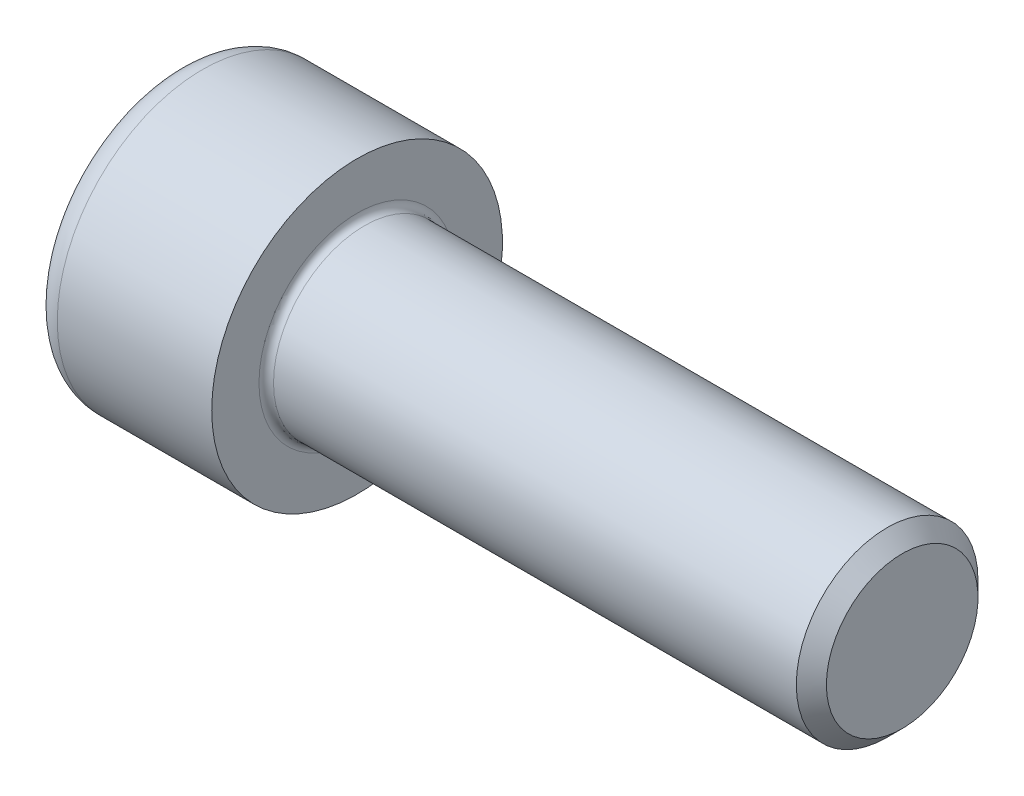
ISO-10303-21;
HEADER;
FILE_DESCRIPTION(('STEP AP214'),'2;1');
FILE_NAME('part.step','',(''),(''),'','','');
FILE_SCHEMA(('AUTOMOTIVE_DESIGN { 1 0 10303 214 1 1 1 1 }'));
ENDSEC;
DATA;
#1=APPLICATION_CONTEXT('core data for automotive mechanical design processes');
#2=APPLICATION_PROTOCOL_DEFINITION('international standard','automotive_design',2000,#1);
#3=PRODUCT_CONTEXT('',#1,'mechanical');
#4=PRODUCT('Part','Part','',(#3));
#5=PRODUCT_RELATED_PRODUCT_CATEGORY('part','',(#4));
#6=PRODUCT_DEFINITION_FORMATION('','',#4);
#7=PRODUCT_DEFINITION_CONTEXT('part definition',#1,'design');
#8=PRODUCT_DEFINITION('design','',#6,#7);
#9=PRODUCT_DEFINITION_SHAPE('','',#8);
#10=(LENGTH_UNIT() NAMED_UNIT(*) SI_UNIT(.MILLI.,.METRE.));
#11=(NAMED_UNIT(*) PLANE_ANGLE_UNIT() SI_UNIT($,.RADIAN.));
#12=(NAMED_UNIT(*) SI_UNIT($,.STERADIAN.) SOLID_ANGLE_UNIT());
#13=UNCERTAINTY_MEASURE_WITH_UNIT(LENGTH_MEASURE(1.E-05),#10,'distance_accuracy_value','');
#14=(GEOMETRIC_REPRESENTATION_CONTEXT(3) GLOBAL_UNCERTAINTY_ASSIGNED_CONTEXT((#13)) GLOBAL_UNIT_ASSIGNED_CONTEXT((#10,
#11,#12)) REPRESENTATION_CONTEXT('',''));
#15=CARTESIAN_POINT('',(0.,0.,0.));
#16=DIRECTION('',(0.,0.,1.));
#17=DIRECTION('',(1.,0.,0.));
#18=AXIS2_PLACEMENT_3D('',#15,#16,#17);
#19=CARTESIAN_POINT('',(0.,0.,0.));
#20=DIRECTION('',(-1.,0.,0.));
#21=DIRECTION('',(0.,0.,1.));
#22=AXIS2_PLACEMENT_3D('',#19,#20,#21);
#23=PLANE('',#22);
#24=DIRECTION('',(0.,-0.499999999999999,0.866025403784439));
#25=VECTOR('',#24,1.);
#26=CARTESIAN_POINT('',(0.,4.68519743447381,0.));
#27=LINE('',#26,#25);
#28=CARTESIAN_POINT('',(0.,4.68519743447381,0.));
#29=VERTEX_POINT('',#28);
#30=CARTESIAN_POINT('',(0.,2.34259871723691,4.05749999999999));
#31=VERTEX_POINT('',#30);
#32=EDGE_CURVE('E266',#29,#31,#27,.T.);
#33=ORIENTED_EDGE('',*,*,#32,.T.);
#34=DIRECTION('',(0.,1.,0.));
#35=VECTOR('',#34,1.);
#36=CARTESIAN_POINT('',(0.,-2.34259871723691,4.0575));
#37=LINE('',#36,#35);
#38=CARTESIAN_POINT('',(0.,-2.34259871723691,4.0575));
#39=VERTEX_POINT('',#38);
#40=EDGE_CURVE('E138',#39,#31,#37,.T.);
#41=ORIENTED_EDGE('',*,*,#40,.F.);
#42=DIRECTION('',(0.,-0.500000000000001,-0.866025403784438));
#43=VECTOR('',#42,1.);
#44=CARTESIAN_POINT('',(0.,-2.34259871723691,4.0575));
#45=LINE('',#44,#43);
#46=CARTESIAN_POINT('',(0.,-4.68519743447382,0.));
#47=VERTEX_POINT('',#46);
#48=EDGE_CURVE('E269',#39,#47,#45,.T.);
#49=ORIENTED_EDGE('',*,*,#48,.T.);
#50=DIRECTION('',(0.,0.499999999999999,-0.866025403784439));
#51=VECTOR('',#50,1.);
#52=CARTESIAN_POINT('',(0.,-4.68519743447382,0.));
#53=LINE('',#52,#51);
#54=CARTESIAN_POINT('',(0.,-2.34259871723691,-4.0575));
#55=VERTEX_POINT('',#54);
#56=EDGE_CURVE('E272',#47,#55,#53,.T.);
#57=ORIENTED_EDGE('',*,*,#56,.T.);
#58=DIRECTION('',(0.,-1.,0.));
#59=VECTOR('',#58,1.);
#60=CARTESIAN_POINT('',(0.,2.3425987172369,-4.0575));
#61=LINE('',#60,#59);
#62=CARTESIAN_POINT('',(0.,2.3425987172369,-4.0575));
#63=VERTEX_POINT('',#62);
#64=EDGE_CURVE('E275',#63,#55,#61,.T.);
#65=ORIENTED_EDGE('',*,*,#64,.F.);
#66=DIRECTION('',(0.,-0.500000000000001,-0.866025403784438));
#67=VECTOR('',#66,1.);
#68=CARTESIAN_POINT('',(0.,4.68519743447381,0.));
#69=LINE('',#68,#67);
#70=EDGE_CURVE('E133',#29,#63,#69,.T.);
#71=ORIENTED_EDGE('',*,*,#70,.F.);
#72=EDGE_LOOP('',(#33,#41,#49,#57,#65,#71));
#73=FACE_BOUND('',#72,.T.);
#74=CARTESIAN_POINT('',(0.,0.,0.));
#75=DIRECTION('',(-1.,0.,0.));
#76=DIRECTION('',(0.,0.,1.));
#77=AXIS2_PLACEMENT_3D('',#74,#75,#76);
#78=CIRCLE('',#77,6.5);
#79=CARTESIAN_POINT('',(0.,0.,6.5));
#80=VERTEX_POINT('',#79);
#81=EDGE_CURVE('E50',#80,#80,#78,.T.);
#82=ORIENTED_EDGE('',*,*,#81,.T.);
#83=EDGE_LOOP('',(#82));
#84=FACE_BOUND('',#83,.T.);
#85=ADVANCED_FACE('F42',(#73,#84),#23,.T.);
#86=CARTESIAN_POINT('',(-31.75,0.,0.));
#87=DIRECTION('',(-1.,0.,0.));
#88=DIRECTION('',(0.,0.,1.));
#89=AXIS2_PLACEMENT_3D('',#86,#87,#88);
#90=CYLINDRICAL_SURFACE('',#89,8.);
#91=CARTESIAN_POINT('',(1.5,0.,0.));
#92=DIRECTION('',(-1.,0.,0.));
#93=DIRECTION('',(0.,0.,1.));
#94=AXIS2_PLACEMENT_3D('',#91,#92,#93);
#95=CIRCLE('',#94,8.);
#96=CARTESIAN_POINT('',(1.5,0.,8.));
#97=VERTEX_POINT('',#96);
#98=EDGE_CURVE('E13',#97,#97,#95,.F.);
#99=ORIENTED_EDGE('',*,*,#98,.T.);
#100=EDGE_LOOP('',(#99));
#101=FACE_BOUND('',#100,.T.);
#102=CARTESIAN_POINT('',(10.,0.,0.));
#103=DIRECTION('',(-1.,0.,0.));
#104=DIRECTION('',(0.,0.,1.));
#105=AXIS2_PLACEMENT_3D('',#102,#103,#104);
#106=CIRCLE('',#105,8.);
#107=CARTESIAN_POINT('',(10.,0.,8.));
#108=VERTEX_POINT('',#107);
#109=EDGE_CURVE('E156',#108,#108,#106,.T.);
#110=ORIENTED_EDGE('',*,*,#109,.T.);
#111=EDGE_LOOP('',(#110));
#112=FACE_BOUND('',#111,.T.);
#113=ADVANCED_FACE('F180',(#101,#112),#90,.T.);
#114=CARTESIAN_POINT('',(10.,7.99999999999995,0.));
#115=DIRECTION('',(1.,0.,0.));
#116=DIRECTION('',(0.,0.,-1.));
#117=AXIS2_PLACEMENT_3D('',#114,#115,#116);
#118=PLANE('',#117);
#119=CARTESIAN_POINT('',(10.,0.,0.));
#120=DIRECTION('',(1.,0.,0.));
#121=DIRECTION('',(0.,0.,-1.));
#122=AXIS2_PLACEMENT_3D('',#119,#120,#121);
#123=CIRCLE('',#122,5.39999999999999);
#124=CARTESIAN_POINT('',(10.,0.,-5.39999999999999));
#125=VERTEX_POINT('',#124);
#126=EDGE_CURVE('E159',#125,#125,#123,.F.);
#127=ORIENTED_EDGE('',*,*,#126,.T.);
#128=EDGE_LOOP('',(#127));
#129=FACE_BOUND('',#128,.T.);
#130=ORIENTED_EDGE('',*,*,#109,.F.);
#131=EDGE_LOOP('',(#130));
#132=FACE_BOUND('',#131,.T.);
#133=ADVANCED_FACE('F186',(#129,#132),#118,.T.);
#134=CARTESIAN_POINT('',(-31.75,0.,0.));
#135=DIRECTION('',(-1.,0.,0.));
#136=DIRECTION('',(0.,0.,1.));
#137=AXIS2_PLACEMENT_3D('',#134,#135,#136);
#138=CYLINDRICAL_SURFACE('',#137,4.99999999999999);
#139=CARTESIAN_POINT('',(10.4,0.,0.));
#140=DIRECTION('',(1.,0.,0.));
#141=DIRECTION('',(0.,0.,-1.));
#142=AXIS2_PLACEMENT_3D('',#139,#140,#141);
#143=CIRCLE('',#142,4.99999999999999);
#144=CARTESIAN_POINT('',(10.4,0.,-4.99999999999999));
#145=VERTEX_POINT('',#144);
#146=EDGE_CURVE('E162',#145,#145,#143,.T.);
#147=ORIENTED_EDGE('',*,*,#146,.T.);
#148=EDGE_LOOP('',(#147));
#149=FACE_BOUND('',#148,.T.);
#150=CARTESIAN_POINT('',(39.172,0.,0.));
#151=DIRECTION('',(-1.,0.,0.));
#152=DIRECTION('',(0.,0.,1.));
#153=AXIS2_PLACEMENT_3D('',#150,#151,#152);
#154=CIRCLE('',#153,4.99999999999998);
#155=CARTESIAN_POINT('',(39.172,0.,4.99999999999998));
#156=VERTEX_POINT('',#155);
#157=EDGE_CURVE('E153',#156,#156,#154,.T.);
#158=ORIENTED_EDGE('',*,*,#157,.T.);
#159=EDGE_LOOP('',(#158));
#160=FACE_BOUND('',#159,.T.);
#161=ADVANCED_FACE('F192',(#149,#160),#138,.T.);
#162=CARTESIAN_POINT('',(40.,0.,0.));
#163=DIRECTION('',(-1.,0.,0.));
#164=DIRECTION('',(0.,0.,1.));
#165=AXIS2_PLACEMENT_3D('',#162,#163,#164);
#166=CONICAL_SURFACE('',#165,4.172,0.785398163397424);
#167=ORIENTED_EDGE('',*,*,#157,.F.);
#168=EDGE_LOOP('',(#167));
#169=FACE_BOUND('',#168,.T.);
#170=CARTESIAN_POINT('',(40.,0.,0.));
#171=DIRECTION('',(-1.,0.,0.));
#172=DIRECTION('',(0.,0.,1.));
#173=AXIS2_PLACEMENT_3D('',#170,#171,#172);
#174=CIRCLE('',#173,4.172);
#175=CARTESIAN_POINT('',(40.,0.,4.172));
#176=VERTEX_POINT('',#175);
#177=EDGE_CURVE('E149',#176,#176,#174,.T.);
#178=ORIENTED_EDGE('',*,*,#177,.T.);
#179=EDGE_LOOP('',(#178));
#180=FACE_BOUND('',#179,.T.);
#181=ADVANCED_FACE('F196',(#169,#180),#166,.T.);
#182=CARTESIAN_POINT('',(40.,4.172,0.));
#183=DIRECTION('',(1.,0.,0.));
#184=DIRECTION('',(0.,0.,-1.));
#185=AXIS2_PLACEMENT_3D('',#182,#183,#184);
#186=PLANE('',#185);
#187=ORIENTED_EDGE('',*,*,#177,.F.);
#188=EDGE_LOOP('',(#187));
#189=FACE_BOUND('',#188,.T.);
#190=ADVANCED_FACE('F176',(#189),#186,.T.);
#191=CARTESIAN_POINT('',(10.4,0.,0.));
#192=DIRECTION('',(1.,0.,0.));
#193=DIRECTION('',(0.,0.,-1.));
#194=AXIS2_PLACEMENT_3D('',#191,#192,#193);
#195=TOROIDAL_SURFACE('',#194,5.39999999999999,0.4);
#196=ORIENTED_EDGE('',*,*,#146,.F.);
#197=EDGE_LOOP('',(#196));
#198=FACE_BOUND('',#197,.T.);
#199=ORIENTED_EDGE('',*,*,#126,.F.);
#200=EDGE_LOOP('',(#199));
#201=FACE_BOUND('',#200,.T.);
#202=ADVANCED_FACE('F169',(#198,#201),#195,.F.);
#203=CARTESIAN_POINT('',(1.5,0.,0.));
#204=DIRECTION('',(-1.,0.,0.));
#205=DIRECTION('',(0.,0.,1.));
#206=AXIS2_PLACEMENT_3D('',#203,#204,#205);
#207=TOROIDAL_SURFACE('',#206,6.5,1.5);
#208=ORIENTED_EDGE('',*,*,#98,.F.);
#209=EDGE_LOOP('',(#208));
#210=FACE_BOUND('',#209,.T.);
#211=ORIENTED_EDGE('',*,*,#81,.F.);
#212=EDGE_LOOP('',(#211));
#213=FACE_BOUND('',#212,.T.);
#214=ADVANCED_FACE('F44',(#210,#213),#207,.T.);
#215=CARTESIAN_POINT('',(5.,4.68519743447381,0.));
#216=DIRECTION('',(0.,-0.866025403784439,-0.499999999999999));
#217=DIRECTION('',(0.,0.499999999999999,-0.866025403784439));
#218=AXIS2_PLACEMENT_3D('',#215,#216,#217);
#219=PLANE('',#218);
#220=ORIENTED_EDGE('',*,*,#32,.F.);
#221=DIRECTION('',(-1.,0.,0.));
#222=VECTOR('',#221,1.);
#223=CARTESIAN_POINT('',(5.,4.68519743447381,0.));
#224=LINE('',#223,#222);
#225=CARTESIAN_POINT('',(5.,4.68519743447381,0.));
#226=VERTEX_POINT('',#225);
#227=EDGE_CURVE('E256',#226,#29,#224,.T.);
#228=ORIENTED_EDGE('',*,*,#227,.F.);
#229=DIRECTION('',(0.,-0.499999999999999,0.866025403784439));
#230=VECTOR('',#229,1.);
#231=CARTESIAN_POINT('',(5.,4.68519743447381,0.));
#232=LINE('',#231,#230);
#233=CARTESIAN_POINT('',(5.,3.51389807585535,2.02875));
#234=VERTEX_POINT('',#233);
#235=EDGE_CURVE('E125',#226,#234,#232,.T.);
#236=ORIENTED_EDGE('',*,*,#235,.T.);
#237=CARTESIAN_POINT('',(5.,2.3425987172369,4.05749999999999));
#238=VERTEX_POINT('',#237);
#239=EDGE_CURVE('E116',#234,#238,#232,.T.);
#240=ORIENTED_EDGE('',*,*,#239,.T.);
#241=DIRECTION('',(-1.,0.,0.));
#242=VECTOR('',#241,1.);
#243=CARTESIAN_POINT('',(5.,2.3425987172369,4.05749999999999));
#244=LINE('',#243,#242);
#245=EDGE_CURVE('E130',#238,#31,#244,.T.);
#246=ORIENTED_EDGE('',*,*,#245,.T.);
#247=EDGE_LOOP('',(#220,#228,#236,#240,#246));
#248=FACE_BOUND('',#247,.T.);
#249=ADVANCED_FACE('F129',(#248),#219,.T.);
#250=CARTESIAN_POINT('',(5.,-2.34259871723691,4.0575));
#251=DIRECTION('',(0.,0.,1.));
#252=DIRECTION('',(0.,-1.,0.));
#253=AXIS2_PLACEMENT_3D('',#250,#251,#252);
#254=PLANE('',#253);
#255=ORIENTED_EDGE('',*,*,#40,.T.);
#256=ORIENTED_EDGE('',*,*,#245,.F.);
#257=DIRECTION('',(0.,1.,0.));
#258=VECTOR('',#257,1.);
#259=CARTESIAN_POINT('',(5.,-2.34259871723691,4.0575));
#260=LINE('',#259,#258);
#261=CARTESIAN_POINT('',(5.,0.,4.0575));
#262=VERTEX_POINT('',#261);
#263=EDGE_CURVE('E113',#262,#238,#260,.T.);
#264=ORIENTED_EDGE('',*,*,#263,.F.);
#265=CARTESIAN_POINT('',(5.,-2.34259871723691,4.0575));
#266=VERTEX_POINT('',#265);
#267=EDGE_CURVE('E124',#266,#262,#260,.T.);
#268=ORIENTED_EDGE('',*,*,#267,.F.);
#269=DIRECTION('',(-1.,0.,0.));
#270=VECTOR('',#269,1.);
#271=CARTESIAN_POINT('',(5.,-2.34259871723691,4.0575));
#272=LINE('',#271,#270);
#273=EDGE_CURVE('E140',#266,#39,#272,.T.);
#274=ORIENTED_EDGE('',*,*,#273,.T.);
#275=EDGE_LOOP('',(#255,#256,#264,#268,#274));
#276=FACE_BOUND('',#275,.T.);
#277=ADVANCED_FACE('F135',(#276),#254,.F.);
#278=CARTESIAN_POINT('',(5.,-2.34259871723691,4.0575));
#279=DIRECTION('',(0.,0.866025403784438,-0.500000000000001));
#280=DIRECTION('',(0.,0.500000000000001,0.866025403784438));
#281=AXIS2_PLACEMENT_3D('',#278,#279,#280);
#282=PLANE('',#281);
#283=ORIENTED_EDGE('',*,*,#48,.F.);
#284=ORIENTED_EDGE('',*,*,#273,.F.);
#285=DIRECTION('',(0.,-0.500000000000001,-0.866025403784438));
#286=VECTOR('',#285,1.);
#287=CARTESIAN_POINT('',(5.,-2.34259871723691,4.0575));
#288=LINE('',#287,#286);
#289=CARTESIAN_POINT('',(5.,-3.51389807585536,2.02875));
#290=VERTEX_POINT('',#289);
#291=EDGE_CURVE('E295',#266,#290,#288,.T.);
#292=ORIENTED_EDGE('',*,*,#291,.T.);
#293=CARTESIAN_POINT('',(5.,-4.68519743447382,0.));
#294=VERTEX_POINT('',#293);
#295=EDGE_CURVE('E284',#290,#294,#288,.T.);
#296=ORIENTED_EDGE('',*,*,#295,.T.);
#297=DIRECTION('',(-1.,0.,0.));
#298=VECTOR('',#297,1.);
#299=CARTESIAN_POINT('',(5.,-4.68519743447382,0.));
#300=LINE('',#299,#298);
#301=EDGE_CURVE('E145',#294,#47,#300,.T.);
#302=ORIENTED_EDGE('',*,*,#301,.T.);
#303=EDGE_LOOP('',(#283,#284,#292,#296,#302));
#304=FACE_BOUND('',#303,.T.);
#305=ADVANCED_FACE('F210',(#304),#282,.T.);
#306=CARTESIAN_POINT('',(5.,-4.68519743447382,0.));
#307=DIRECTION('',(0.,0.866025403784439,0.499999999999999));
#308=DIRECTION('',(0.,-0.499999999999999,0.866025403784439));
#309=AXIS2_PLACEMENT_3D('',#306,#307,#308);
#310=PLANE('',#309);
#311=ORIENTED_EDGE('',*,*,#56,.F.);
#312=ORIENTED_EDGE('',*,*,#301,.F.);
#313=DIRECTION('',(0.,0.499999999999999,-0.866025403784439));
#314=VECTOR('',#313,1.);
#315=CARTESIAN_POINT('',(5.,-4.68519743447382,0.));
#316=LINE('',#315,#314);
#317=CARTESIAN_POINT('',(5.,-3.51389807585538,-2.02875));
#318=VERTEX_POINT('',#317);
#319=EDGE_CURVE('E262',#294,#318,#316,.T.);
#320=ORIENTED_EDGE('',*,*,#319,.T.);
#321=CARTESIAN_POINT('',(5.,-2.34259871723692,-4.0575));
#322=VERTEX_POINT('',#321);
#323=EDGE_CURVE('E294',#318,#322,#316,.T.);
#324=ORIENTED_EDGE('',*,*,#323,.T.);
#325=DIRECTION('',(-1.,0.,0.));
#326=VECTOR('',#325,1.);
#327=CARTESIAN_POINT('',(5.,-2.34259871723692,-4.0575));
#328=LINE('',#327,#326);
#329=EDGE_CURVE('E255',#322,#55,#328,.T.);
#330=ORIENTED_EDGE('',*,*,#329,.T.);
#331=EDGE_LOOP('',(#311,#312,#320,#324,#330));
#332=FACE_BOUND('',#331,.T.);
#333=ADVANCED_FACE('F213',(#332),#310,.T.);
#334=CARTESIAN_POINT('',(5.,2.3425987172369,-4.0575));
#335=DIRECTION('',(0.,0.,-1.));
#336=DIRECTION('',(0.,1.,0.));
#337=AXIS2_PLACEMENT_3D('',#334,#335,#336);
#338=PLANE('',#337);
#339=ORIENTED_EDGE('',*,*,#64,.T.);
#340=ORIENTED_EDGE('',*,*,#329,.F.);
#341=DIRECTION('',(0.,-1.,0.));
#342=VECTOR('',#341,1.);
#343=CARTESIAN_POINT('',(5.,2.3425987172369,-4.0575));
#344=LINE('',#343,#342);
#345=CARTESIAN_POINT('',(5.,0.,-4.0575));
#346=VERTEX_POINT('',#345);
#347=EDGE_CURVE('E259',#346,#322,#344,.T.);
#348=ORIENTED_EDGE('',*,*,#347,.F.);
#349=CARTESIAN_POINT('',(5.,2.3425987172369,-4.0575));
#350=VERTEX_POINT('',#349);
#351=EDGE_CURVE('E57',#350,#346,#344,.T.);
#352=ORIENTED_EDGE('',*,*,#351,.F.);
#353=DIRECTION('',(-1.,0.,0.));
#354=VECTOR('',#353,1.);
#355=CARTESIAN_POINT('',(5.,2.3425987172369,-4.0575));
#356=LINE('',#355,#354);
#357=EDGE_CURVE('E252',#350,#63,#356,.T.);
#358=ORIENTED_EDGE('',*,*,#357,.T.);
#359=EDGE_LOOP('',(#339,#340,#348,#352,#358));
#360=FACE_BOUND('',#359,.T.);
#361=ADVANCED_FACE('F217',(#360),#338,.F.);
#362=CARTESIAN_POINT('',(5.,4.68519743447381,0.));
#363=DIRECTION('',(0.,0.866025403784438,-0.500000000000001));
#364=DIRECTION('',(0.,0.500000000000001,0.866025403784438));
#365=AXIS2_PLACEMENT_3D('',#362,#363,#364);
#366=PLANE('',#365);
#367=ORIENTED_EDGE('',*,*,#70,.T.);
#368=ORIENTED_EDGE('',*,*,#357,.F.);
#369=DIRECTION('',(0.,-0.500000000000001,-0.866025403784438));
#370=VECTOR('',#369,1.);
#371=CARTESIAN_POINT('',(5.,4.68519743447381,0.));
#372=LINE('',#371,#370);
#373=CARTESIAN_POINT('',(5.,3.51389807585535,-2.02875));
#374=VERTEX_POINT('',#373);
#375=EDGE_CURVE('E242',#374,#350,#372,.T.);
#376=ORIENTED_EDGE('',*,*,#375,.F.);
#377=EDGE_CURVE('E248',#226,#374,#372,.T.);
#378=ORIENTED_EDGE('',*,*,#377,.F.);
#379=ORIENTED_EDGE('',*,*,#227,.T.);
#380=EDGE_LOOP('',(#367,#368,#376,#378,#379));
#381=FACE_BOUND('',#380,.T.);
#382=ADVANCED_FACE('F221',(#381),#366,.F.);
#383=CARTESIAN_POINT('',(5.,4.68519743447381,0.));
#384=DIRECTION('',(1.,0.,0.));
#385=DIRECTION('',(0.,0.,-1.));
#386=AXIS2_PLACEMENT_3D('',#383,#384,#385);
#387=PLANE('',#386);
#388=ORIENTED_EDGE('',*,*,#347,.T.);
#389=ORIENTED_EDGE('',*,*,#323,.F.);
#390=CARTESIAN_POINT('',(5.,0.,0.));
#391=DIRECTION('',(-1.,0.,0.));
#392=DIRECTION('',(0.,0.,1.));
#393=AXIS2_PLACEMENT_3D('',#390,#391,#392);
#394=CIRCLE('',#393,4.0575);
#395=EDGE_CURVE('E290',#346,#318,#394,.T.);
#396=ORIENTED_EDGE('',*,*,#395,.F.);
#397=EDGE_LOOP('',(#388,#389,#396));
#398=FACE_BOUND('',#397,.T.);
#399=ADVANCED_FACE('F225',(#398),#387,.F.);
#400=ORIENTED_EDGE('',*,*,#319,.F.);
#401=ORIENTED_EDGE('',*,*,#295,.F.);
#402=EDGE_CURVE('E143',#318,#290,#394,.T.);
#403=ORIENTED_EDGE('',*,*,#402,.F.);
#404=EDGE_LOOP('',(#400,#401,#403));
#405=FACE_BOUND('',#404,.T.);
#406=ADVANCED_FACE('F228',(#405),#387,.F.);
#407=ORIENTED_EDGE('',*,*,#291,.F.);
#408=ORIENTED_EDGE('',*,*,#267,.T.);
#409=EDGE_CURVE('E139',#290,#262,#394,.T.);
#410=ORIENTED_EDGE('',*,*,#409,.F.);
#411=EDGE_LOOP('',(#407,#408,#410));
#412=FACE_BOUND('',#411,.T.);
#413=ADVANCED_FACE('F233',(#412),#387,.F.);
#414=ORIENTED_EDGE('',*,*,#263,.T.);
#415=ORIENTED_EDGE('',*,*,#239,.F.);
#416=EDGE_CURVE('E119',#262,#234,#394,.T.);
#417=ORIENTED_EDGE('',*,*,#416,.F.);
#418=EDGE_LOOP('',(#414,#415,#417));
#419=FACE_BOUND('',#418,.T.);
#420=ADVANCED_FACE('F115',(#419),#387,.F.);
#421=ORIENTED_EDGE('',*,*,#235,.F.);
#422=ORIENTED_EDGE('',*,*,#377,.T.);
#423=EDGE_CURVE('E150',#234,#374,#394,.T.);
#424=ORIENTED_EDGE('',*,*,#423,.F.);
#425=EDGE_LOOP('',(#421,#422,#424));
#426=FACE_BOUND('',#425,.T.);
#427=ADVANCED_FACE('F236',(#426),#387,.F.);
#428=ORIENTED_EDGE('',*,*,#375,.T.);
#429=ORIENTED_EDGE('',*,*,#351,.T.);
#430=EDGE_CURVE('E245',#374,#346,#394,.T.);
#431=ORIENTED_EDGE('',*,*,#430,.F.);
#432=EDGE_LOOP('',(#428,#429,#431));
#433=FACE_BOUND('',#432,.T.);
#434=ADVANCED_FACE('F206',(#433),#387,.F.);
#435=CARTESIAN_POINT('',(5.,0.,0.));
#436=DIRECTION('',(-1.,0.,0.));
#437=DIRECTION('',(0.,0.,1.));
#438=AXIS2_PLACEMENT_3D('',#435,#436,#437);
#439=CONICAL_SURFACE('',#438,4.0575,1.04719755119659);
#440=CARTESIAN_POINT('',(7.34259871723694,0.,0.));
#441=VERTEX_POINT('',#440);
#442=VERTEX_LOOP('',#441);
#443=FACE_BOUND('',#442,.T.);
#444=ORIENTED_EDGE('',*,*,#416,.T.);
#445=ORIENTED_EDGE('',*,*,#423,.T.);
#446=ORIENTED_EDGE('',*,*,#430,.T.);
#447=ORIENTED_EDGE('',*,*,#395,.T.);
#448=ORIENTED_EDGE('',*,*,#402,.T.);
#449=ORIENTED_EDGE('',*,*,#409,.T.);
#450=EDGE_LOOP('',(#444,#445,#446,#447,#448,#449));
#451=FACE_BOUND('',#450,.T.);
#452=ADVANCED_FACE('F204',(#443,#451),#439,.F.);
#453=CLOSED_SHELL('',(#85,#113,#133,#161,#181,#190,#202,#214,#249,#277,#305,#333,#361,#382,#399,
#406,#413,#420,#427,#434,#452));
#454=MANIFOLD_SOLID_BREP('B2',#453);
#455=ADVANCED_BREP_SHAPE_REPRESENTATION('',(#18,#454),#14);
#456=SHAPE_DEFINITION_REPRESENTATION(#9,#455);
ENDSEC;
END-ISO-10303-21;
